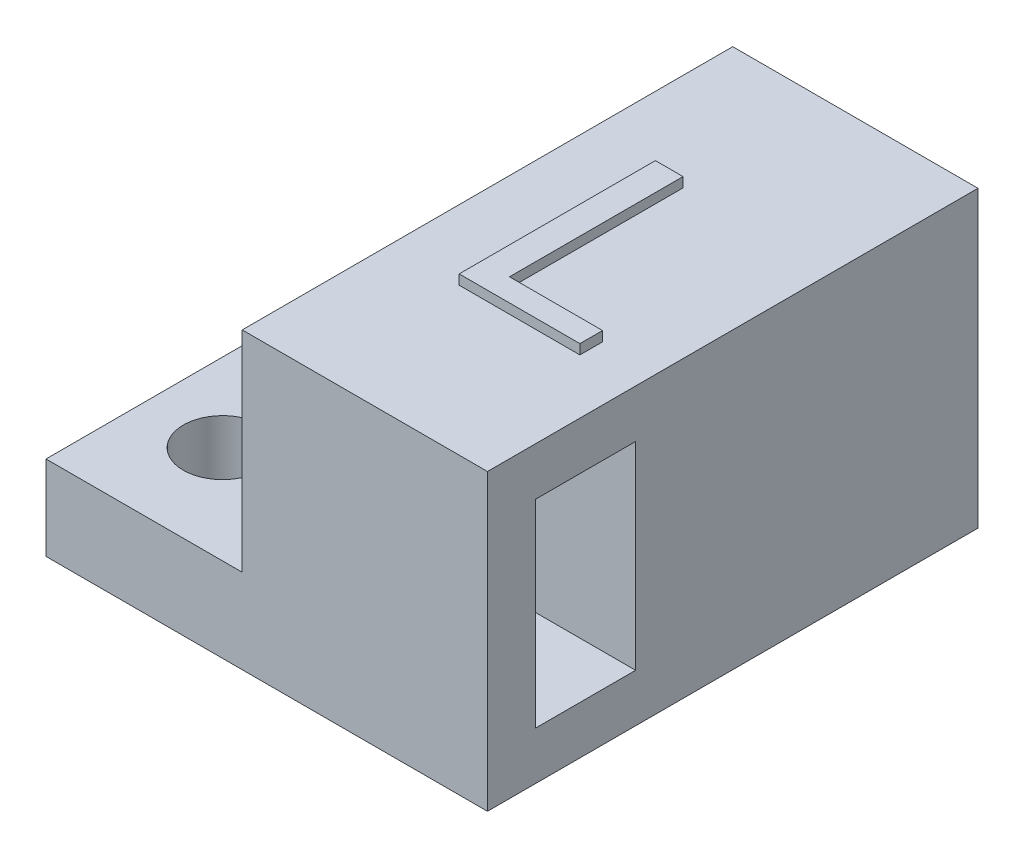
from build123d import *

# Parameters (mm, degrees)
SKETCH1_W           = 25
SKETCH1_H           = 50
BOSS_EXTRUDE1_DEPTH = 30
SKETCH2_W           = 50
SKETCH2_H           = 8.605036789
BOSS_EXTRUDE2_DEPTH = 20
SKETCH3_R           = 4
CUT_EXTRUDE1_DEPTH  = 47.249264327
SKETCH4_W           = 10.2
SKETCH4_H           = 20.2
CUT_EXTRUDE2_DEPTH  = 20
BOSS_EXTRUDE3_DEPTH = 1


with BuildPart() as part:
    # Sketch1 → Boss-Extrude1 (new body)
    with BuildSketch(Plane(origin=(0, 0, 0), x_dir=(1, 0, 0), z_dir=(0, 1, 0))):
        Rectangle(SKETCH1_W, SKETCH1_H)
    extrude(amount=BOSS_EXTRUDE1_DEPTH)

    # Sketch2 → Boss-Extrude2 (add)
    with BuildSketch(Plane.ZY.offset(12.5)):
        with Locations((0, 4.302518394)):
            Rectangle(SKETCH2_W, SKETCH2_H)
    extrude(amount=BOSS_EXTRUDE2_DEPTH)

    # Sketch3 → Cut-Extrude1 (cut, through all)
    with BuildSketch(Plane(origin=(0, 8.605036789, 0), x_dir=(1, 0, 0), z_dir=(0, 1, 0))):
        with Locations(Location((-24.5, 15, 0), (0, 0, 270))):
            Circle(SKETCH3_R)
        with Locations(Location((-24.5, -15, 0), (0, 0, 270))):
            Circle(SKETCH3_R)
    extrude(amount=-CUT_EXTRUDE1_DEPTH, mode=Mode.SUBTRACT)

    # Sketch4 → Cut-Extrude2 (cut)
    with BuildSketch(Plane(origin=(12.5, 0, 0), x_dir=(0, 0, -1), z_dir=(1, 0, 0))):
        with Locations((-15, 15)):
            Rectangle(SKETCH4_W, SKETCH4_H)
    extrude(amount=-CUT_EXTRUDE2_DEPTH, mode=Mode.SUBTRACT)

    # Sketch5 → Boss-Extrude3 (add)
    with BuildSketch(Plane(origin=(0, 30, 0), x_dir=(1, 0, 0), z_dir=(0, 1, 0))):
        Polygon((-5.384615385, -10), (-5.384615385, 10), (-2.564102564, 10), (-2.564102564, -7.692307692), (6.923076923, -7.692307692), (6.923076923, -10), align=None)
    extrude(amount=BOSS_EXTRUDE3_DEPTH)


solid = part.part
